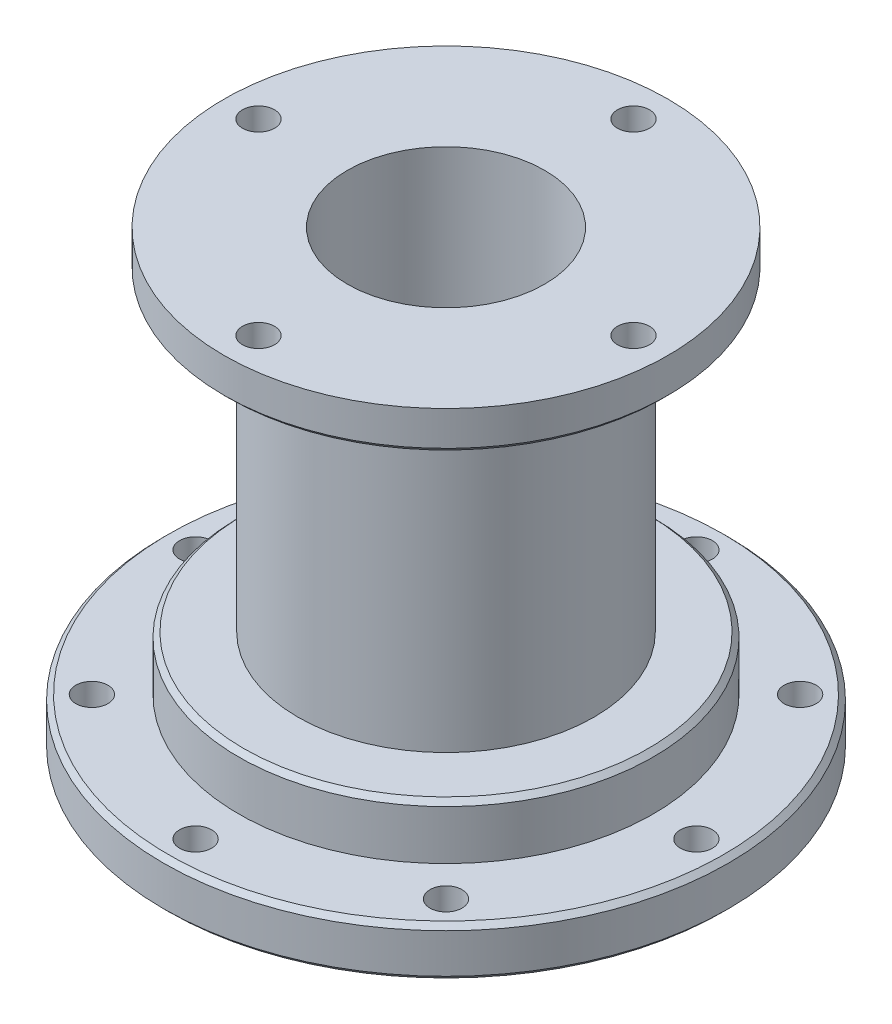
ISO-10303-21;
HEADER;
FILE_DESCRIPTION(('STEP AP214'),'2;1');
FILE_NAME('part.step','',(''),(''),'','','');
FILE_SCHEMA(('AUTOMOTIVE_DESIGN { 1 0 10303 214 1 1 1 1 }'));
ENDSEC;
DATA;
#1=APPLICATION_CONTEXT('core data for automotive mechanical design processes');
#2=APPLICATION_PROTOCOL_DEFINITION('international standard','automotive_design',2000,#1);
#3=PRODUCT_CONTEXT('',#1,'mechanical');
#4=PRODUCT('Part','Part','',(#3));
#5=PRODUCT_RELATED_PRODUCT_CATEGORY('part','',(#4));
#6=PRODUCT_DEFINITION_FORMATION('','',#4);
#7=PRODUCT_DEFINITION_CONTEXT('part definition',#1,'design');
#8=PRODUCT_DEFINITION('design','',#6,#7);
#9=PRODUCT_DEFINITION_SHAPE('','',#8);
#10=(LENGTH_UNIT() NAMED_UNIT(*) SI_UNIT(.MILLI.,.METRE.));
#11=(NAMED_UNIT(*) PLANE_ANGLE_UNIT() SI_UNIT($,.RADIAN.));
#12=(NAMED_UNIT(*) SI_UNIT($,.STERADIAN.) SOLID_ANGLE_UNIT());
#13=UNCERTAINTY_MEASURE_WITH_UNIT(LENGTH_MEASURE(1.E-05),#10,'distance_accuracy_value','');
#14=(GEOMETRIC_REPRESENTATION_CONTEXT(3) GLOBAL_UNCERTAINTY_ASSIGNED_CONTEXT((#13)) GLOBAL_UNIT_ASSIGNED_CONTEXT((#10,
#11,#12)) REPRESENTATION_CONTEXT('',''));
#15=CARTESIAN_POINT('',(0.,0.,0.));
#16=DIRECTION('',(0.,0.,1.));
#17=DIRECTION('',(1.,0.,0.));
#18=AXIS2_PLACEMENT_3D('',#15,#16,#17);
#19=CARTESIAN_POINT('',(0.,0.,0.));
#20=DIRECTION('',(0.,-1.,0.));
#21=DIRECTION('',(0.,0.,-1.));
#22=AXIS2_PLACEMENT_3D('',#19,#20,#21);
#23=CYLINDRICAL_SURFACE('',#22,30.);
#24=CARTESIAN_POINT('',(0.,21.,0.));
#25=DIRECTION('',(0.,-1.,0.));
#26=DIRECTION('',(0.,0.,-1.));
#27=AXIS2_PLACEMENT_3D('',#24,#25,#26);
#28=CIRCLE('',#27,30.);
#29=CARTESIAN_POINT('',(0.,21.,-30.));
#30=VERTEX_POINT('',#29);
#31=EDGE_CURVE('E128',#30,#30,#28,.F.);
#32=ORIENTED_EDGE('',*,*,#31,.T.);
#33=EDGE_LOOP('',(#32));
#34=FACE_BOUND('',#33,.T.);
#35=CARTESIAN_POINT('',(0.,84.,0.));
#36=DIRECTION('',(0.,-1.,0.));
#37=DIRECTION('',(0.,0.,-1.));
#38=AXIS2_PLACEMENT_3D('',#35,#36,#37);
#39=CIRCLE('',#38,30.);
#40=CARTESIAN_POINT('',(0.,84.,-30.));
#41=VERTEX_POINT('',#40);
#42=EDGE_CURVE('E18',#41,#41,#39,.T.);
#43=ORIENTED_EDGE('',*,*,#42,.T.);
#44=EDGE_LOOP('',(#43));
#45=FACE_BOUND('',#44,.T.);
#46=ADVANCED_FACE('F15',(#34,#45),#23,.T.);
#47=CARTESIAN_POINT('',(-30.,84.,0.));
#48=DIRECTION('',(0.,1.,0.));
#49=DIRECTION('',(0.,0.,1.));
#50=AXIS2_PLACEMENT_3D('',#47,#48,#49);
#51=PLANE('',#50);
#52=ORIENTED_EDGE('',*,*,#42,.F.);
#53=EDGE_LOOP('',(#52));
#54=FACE_BOUND('',#53,.T.);
#55=CARTESIAN_POINT('',(0.,84.,-38.));
#56=DIRECTION('',(0.,1.,0.));
#57=DIRECTION('',(0.,0.,1.));
#58=AXIS2_PLACEMENT_3D('',#55,#56,#57);
#59=CIRCLE('',#58,3.25);
#60=CARTESIAN_POINT('',(0.,84.,-34.75));
#61=VERTEX_POINT('',#60);
#62=EDGE_CURVE('E116',#61,#61,#59,.T.);
#63=ORIENTED_EDGE('',*,*,#62,.T.);
#64=EDGE_LOOP('',(#63));
#65=FACE_BOUND('',#64,.T.);
#66=CARTESIAN_POINT('',(38.,84.,1.32676290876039E-13));
#67=DIRECTION('',(0.,1.,0.));
#68=DIRECTION('',(0.,0.,1.));
#69=AXIS2_PLACEMENT_3D('',#66,#67,#68);
#70=CIRCLE('',#69,3.25);
#71=CARTESIAN_POINT('',(38.,84.,3.25000000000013));
#72=VERTEX_POINT('',#71);
#73=EDGE_CURVE('E119',#72,#72,#70,.T.);
#74=ORIENTED_EDGE('',*,*,#73,.T.);
#75=EDGE_LOOP('',(#74));
#76=FACE_BOUND('',#75,.T.);
#77=CARTESIAN_POINT('',(0.,84.,38.));
#78=DIRECTION('',(0.,1.,0.));
#79=DIRECTION('',(0.,0.,1.));
#80=AXIS2_PLACEMENT_3D('',#77,#78,#79);
#81=CIRCLE('',#80,3.25);
#82=CARTESIAN_POINT('',(0.,84.,41.25));
#83=VERTEX_POINT('',#82);
#84=EDGE_CURVE('E122',#83,#83,#81,.T.);
#85=ORIENTED_EDGE('',*,*,#84,.T.);
#86=EDGE_LOOP('',(#85));
#87=FACE_BOUND('',#86,.T.);
#88=CARTESIAN_POINT('',(-38.,84.,-3.98028872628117E-13));
#89=DIRECTION('',(0.,1.,0.));
#90=DIRECTION('',(0.,0.,1.));
#91=AXIS2_PLACEMENT_3D('',#88,#89,#90);
#92=CIRCLE('',#91,3.25);
#93=CARTESIAN_POINT('',(-38.,84.,3.2499999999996));
#94=VERTEX_POINT('',#93);
#95=EDGE_CURVE('E125',#94,#94,#92,.T.);
#96=ORIENTED_EDGE('',*,*,#95,.T.);
#97=EDGE_LOOP('',(#96));
#98=FACE_BOUND('',#97,.T.);
#99=CARTESIAN_POINT('',(0.,84.,0.));
#100=DIRECTION('',(0.,1.,0.));
#101=DIRECTION('',(0.,0.,1.));
#102=AXIS2_PLACEMENT_3D('',#99,#100,#101);
#103=CIRCLE('',#102,44.);
#104=CARTESIAN_POINT('',(0.,84.,44.));
#105=VERTEX_POINT('',#104);
#106=EDGE_CURVE('E130',#105,#105,#103,.T.);
#107=ORIENTED_EDGE('',*,*,#106,.F.);
#108=EDGE_LOOP('',(#107));
#109=FACE_BOUND('',#108,.T.);
#110=ADVANCED_FACE('F138',(#54,#65,#76,#87,#98,#109),#51,.F.);
#111=CARTESIAN_POINT('',(0.,85.,0.));
#112=DIRECTION('',(0.,1.,0.));
#113=DIRECTION('',(0.,0.,1.));
#114=AXIS2_PLACEMENT_3D('',#111,#112,#113);
#115=CONICAL_SURFACE('',#114,45.,0.785398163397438);
#116=CARTESIAN_POINT('',(0.,85.,0.));
#117=DIRECTION('',(0.,-1.,0.));
#118=DIRECTION('',(0.,0.,-1.));
#119=AXIS2_PLACEMENT_3D('',#116,#117,#118);
#120=CIRCLE('',#119,45.);
#121=CARTESIAN_POINT('',(0.,85.,-45.));
#122=VERTEX_POINT('',#121);
#123=EDGE_CURVE('E30',#122,#122,#120,.F.);
#124=ORIENTED_EDGE('',*,*,#123,.F.);
#125=EDGE_LOOP('',(#124));
#126=FACE_BOUND('',#125,.T.);
#127=ORIENTED_EDGE('',*,*,#106,.T.);
#128=EDGE_LOOP('',(#127));
#129=FACE_BOUND('',#128,.T.);
#130=ADVANCED_FACE('F141',(#126,#129),#115,.T.);
#131=CARTESIAN_POINT('',(-42.,21.,0.));
#132=DIRECTION('',(0.,-1.,0.));
#133=DIRECTION('',(0.,0.,-1.));
#134=AXIS2_PLACEMENT_3D('',#131,#132,#133);
#135=PLANE('',#134);
#136=ORIENTED_EDGE('',*,*,#31,.F.);
#137=EDGE_LOOP('',(#136));
#138=FACE_BOUND('',#137,.T.);
#139=CARTESIAN_POINT('',(0.,21.,0.));
#140=DIRECTION('',(0.,-1.,0.));
#141=DIRECTION('',(0.,0.,-1.));
#142=AXIS2_PLACEMENT_3D('',#139,#140,#141);
#143=CIRCLE('',#142,41.);
#144=CARTESIAN_POINT('',(0.,21.,-41.));
#145=VERTEX_POINT('',#144);
#146=EDGE_CURVE('E113',#145,#145,#143,.T.);
#147=ORIENTED_EDGE('',*,*,#146,.F.);
#148=EDGE_LOOP('',(#147));
#149=FACE_BOUND('',#148,.T.);
#150=ADVANCED_FACE('F155',(#138,#149),#135,.F.);
#151=CARTESIAN_POINT('',(-38.,74.8076118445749,-3.98028872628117E-13));
#152=DIRECTION('',(0.,1.,0.));
#153=DIRECTION('',(0.,0.,1.));
#154=AXIS2_PLACEMENT_3D('',#151,#152,#153);
#155=CYLINDRICAL_SURFACE('',#154,3.25);
#156=ORIENTED_EDGE('',*,*,#95,.F.);
#157=EDGE_LOOP('',(#156));
#158=FACE_BOUND('',#157,.T.);
#159=CARTESIAN_POINT('',(-38.,92.,-3.98028872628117E-13));
#160=DIRECTION('',(0.,1.,0.));
#161=DIRECTION('',(0.,0.,1.));
#162=AXIS2_PLACEMENT_3D('',#159,#160,#161);
#163=CIRCLE('',#162,3.25);
#164=CARTESIAN_POINT('',(-38.,92.,3.2499999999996));
#165=VERTEX_POINT('',#164);
#166=EDGE_CURVE('E110',#165,#165,#163,.T.);
#167=ORIENTED_EDGE('',*,*,#166,.T.);
#168=EDGE_LOOP('',(#167));
#169=FACE_BOUND('',#168,.T.);
#170=ADVANCED_FACE('F151',(#158,#169),#155,.F.);
#171=CARTESIAN_POINT('',(0.,74.8076118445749,38.));
#172=DIRECTION('',(0.,1.,0.));
#173=DIRECTION('',(0.,0.,1.));
#174=AXIS2_PLACEMENT_3D('',#171,#172,#173);
#175=CYLINDRICAL_SURFACE('',#174,3.25);
#176=ORIENTED_EDGE('',*,*,#84,.F.);
#177=EDGE_LOOP('',(#176));
#178=FACE_BOUND('',#177,.T.);
#179=CARTESIAN_POINT('',(0.,92.,38.));
#180=DIRECTION('',(0.,1.,0.));
#181=DIRECTION('',(0.,0.,1.));
#182=AXIS2_PLACEMENT_3D('',#179,#180,#181);
#183=CIRCLE('',#182,3.25);
#184=CARTESIAN_POINT('',(0.,92.,41.25));
#185=VERTEX_POINT('',#184);
#186=EDGE_CURVE('E107',#185,#185,#183,.T.);
#187=ORIENTED_EDGE('',*,*,#186,.T.);
#188=EDGE_LOOP('',(#187));
#189=FACE_BOUND('',#188,.T.);
#190=ADVANCED_FACE('F154',(#178,#189),#175,.F.);
#191=CARTESIAN_POINT('',(38.,74.8076118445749,1.32676290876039E-13));
#192=DIRECTION('',(0.,1.,0.));
#193=DIRECTION('',(0.,0.,1.));
#194=AXIS2_PLACEMENT_3D('',#191,#192,#193);
#195=CYLINDRICAL_SURFACE('',#194,3.25);
#196=ORIENTED_EDGE('',*,*,#73,.F.);
#197=EDGE_LOOP('',(#196));
#198=FACE_BOUND('',#197,.T.);
#199=CARTESIAN_POINT('',(38.,92.,1.32676290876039E-13));
#200=DIRECTION('',(0.,1.,0.));
#201=DIRECTION('',(0.,0.,1.));
#202=AXIS2_PLACEMENT_3D('',#199,#200,#201);
#203=CIRCLE('',#202,3.25);
#204=CARTESIAN_POINT('',(38.,92.,3.25000000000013));
#205=VERTEX_POINT('',#204);
#206=EDGE_CURVE('E104',#205,#205,#203,.T.);
#207=ORIENTED_EDGE('',*,*,#206,.T.);
#208=EDGE_LOOP('',(#207));
#209=FACE_BOUND('',#208,.T.);
#210=ADVANCED_FACE('F273',(#198,#209),#195,.F.);
#211=CARTESIAN_POINT('',(0.,74.8076118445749,-38.));
#212=DIRECTION('',(0.,1.,0.));
#213=DIRECTION('',(0.,0.,1.));
#214=AXIS2_PLACEMENT_3D('',#211,#212,#213);
#215=CYLINDRICAL_SURFACE('',#214,3.25);
#216=ORIENTED_EDGE('',*,*,#62,.F.);
#217=EDGE_LOOP('',(#216));
#218=FACE_BOUND('',#217,.T.);
#219=CARTESIAN_POINT('',(0.,92.,-38.));
#220=DIRECTION('',(0.,1.,0.));
#221=DIRECTION('',(0.,0.,1.));
#222=AXIS2_PLACEMENT_3D('',#219,#220,#221);
#223=CIRCLE('',#222,3.25);
#224=CARTESIAN_POINT('',(0.,92.,-34.75));
#225=VERTEX_POINT('',#224);
#226=EDGE_CURVE('E101',#225,#225,#223,.T.);
#227=ORIENTED_EDGE('',*,*,#226,.T.);
#228=EDGE_LOOP('',(#227));
#229=FACE_BOUND('',#228,.T.);
#230=ADVANCED_FACE('F277',(#218,#229),#215,.F.);
#231=CARTESIAN_POINT('',(0.,0.,0.));
#232=DIRECTION('',(0.,-1.,0.));
#233=DIRECTION('',(0.,0.,-1.));
#234=AXIS2_PLACEMENT_3D('',#231,#232,#233);
#235=CYLINDRICAL_SURFACE('',#234,45.);
#236=ORIENTED_EDGE('',*,*,#123,.T.);
#237=EDGE_LOOP('',(#236));
#238=FACE_BOUND('',#237,.T.);
#239=CARTESIAN_POINT('',(0.,92.,0.));
#240=DIRECTION('',(0.,-1.,0.));
#241=DIRECTION('',(0.,0.,-1.));
#242=AXIS2_PLACEMENT_3D('',#239,#240,#241);
#243=CIRCLE('',#242,45.);
#244=CARTESIAN_POINT('',(0.,92.,-45.));
#245=VERTEX_POINT('',#244);
#246=EDGE_CURVE('E98',#245,#245,#243,.T.);
#247=ORIENTED_EDGE('',*,*,#246,.T.);
#248=EDGE_LOOP('',(#247));
#249=FACE_BOUND('',#248,.T.);
#250=ADVANCED_FACE('F173',(#238,#249),#235,.T.);
#251=CARTESIAN_POINT('',(0.,20.,0.));
#252=DIRECTION('',(0.,-1.,0.));
#253=DIRECTION('',(0.,0.,-1.));
#254=AXIS2_PLACEMENT_3D('',#251,#252,#253);
#255=CONICAL_SURFACE('',#254,42.,0.785398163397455);
#256=CARTESIAN_POINT('',(0.,20.,0.));
#257=DIRECTION('',(0.,-1.,0.));
#258=DIRECTION('',(0.,0.,-1.));
#259=AXIS2_PLACEMENT_3D('',#256,#257,#258);
#260=CIRCLE('',#259,42.);
#261=CARTESIAN_POINT('',(0.,20.,-42.));
#262=VERTEX_POINT('',#261);
#263=EDGE_CURVE('E97',#262,#262,#260,.T.);
#264=ORIENTED_EDGE('',*,*,#263,.F.);
#265=EDGE_LOOP('',(#264));
#266=FACE_BOUND('',#265,.T.);
#267=ORIENTED_EDGE('',*,*,#146,.T.);
#268=EDGE_LOOP('',(#267));
#269=FACE_BOUND('',#268,.T.);
#270=ADVANCED_FACE('F162',(#266,#269),#255,.T.);
#271=CARTESIAN_POINT('',(-45.,92.,0.));
#272=DIRECTION('',(0.,-1.,0.));
#273=DIRECTION('',(0.,0.,-1.));
#274=AXIS2_PLACEMENT_3D('',#271,#272,#273);
#275=PLANE('',#274);
#276=CARTESIAN_POINT('',(0.,92.,0.));
#277=DIRECTION('',(0.,-1.,0.));
#278=DIRECTION('',(0.,0.,-1.));
#279=AXIS2_PLACEMENT_3D('',#276,#277,#278);
#280=CIRCLE('',#279,20.);
#281=CARTESIAN_POINT('',(0.,92.,-20.));
#282=VERTEX_POINT('',#281);
#283=EDGE_CURVE('E94',#282,#282,#280,.T.);
#284=ORIENTED_EDGE('',*,*,#283,.T.);
#285=EDGE_LOOP('',(#284));
#286=FACE_BOUND('',#285,.T.);
#287=ORIENTED_EDGE('',*,*,#246,.F.);
#288=EDGE_LOOP('',(#287));
#289=FACE_BOUND('',#288,.T.);
#290=ORIENTED_EDGE('',*,*,#226,.F.);
#291=EDGE_LOOP('',(#290));
#292=FACE_BOUND('',#291,.T.);
#293=ORIENTED_EDGE('',*,*,#206,.F.);
#294=EDGE_LOOP('',(#293));
#295=FACE_BOUND('',#294,.T.);
#296=ORIENTED_EDGE('',*,*,#186,.F.);
#297=EDGE_LOOP('',(#296));
#298=FACE_BOUND('',#297,.T.);
#299=ORIENTED_EDGE('',*,*,#166,.F.);
#300=EDGE_LOOP('',(#299));
#301=FACE_BOUND('',#300,.T.);
#302=ADVANCED_FACE('F159',(#286,#289,#292,#295,#298,#301),#275,.F.);
#303=CARTESIAN_POINT('',(0.,9.00000000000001,0.));
#304=DIRECTION('',(0.,-1.,0.));
#305=DIRECTION('',(0.,0.,-1.));
#306=AXIS2_PLACEMENT_3D('',#303,#304,#305);
#307=CONICAL_SURFACE('',#306,57.25,0.785398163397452);
#308=CARTESIAN_POINT('',(0.,10.,0.));
#309=DIRECTION('',(0.,-1.,0.));
#310=DIRECTION('',(0.,0.,-1.));
#311=AXIS2_PLACEMENT_3D('',#308,#309,#310);
#312=CIRCLE('',#311,56.25);
#313=CARTESIAN_POINT('',(0.,10.,-56.25));
#314=VERTEX_POINT('',#313);
#315=EDGE_CURVE('E90',#314,#314,#312,.T.);
#316=ORIENTED_EDGE('',*,*,#315,.T.);
#317=EDGE_LOOP('',(#316));
#318=FACE_BOUND('',#317,.T.);
#319=CARTESIAN_POINT('',(0.,9.00000000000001,0.));
#320=DIRECTION('',(0.,-1.,0.));
#321=DIRECTION('',(0.,0.,-1.));
#322=AXIS2_PLACEMENT_3D('',#319,#320,#321);
#323=CIRCLE('',#322,57.25);
#324=CARTESIAN_POINT('',(0.,9.00000000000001,-57.25));
#325=VERTEX_POINT('',#324);
#326=EDGE_CURVE('E93',#325,#325,#323,.T.);
#327=ORIENTED_EDGE('',*,*,#326,.F.);
#328=EDGE_LOOP('',(#327));
#329=FACE_BOUND('',#328,.T.);
#330=ADVANCED_FACE('F161',(#318,#329),#307,.T.);
#331=CARTESIAN_POINT('',(0.,0.,0.));
#332=DIRECTION('',(0.,-1.,0.));
#333=DIRECTION('',(0.,0.,-1.));
#334=AXIS2_PLACEMENT_3D('',#331,#332,#333);
#335=CYLINDRICAL_SURFACE('',#334,42.);
#336=CARTESIAN_POINT('',(0.,10.,0.));
#337=DIRECTION('',(0.,-1.,0.));
#338=DIRECTION('',(0.,0.,-1.));
#339=AXIS2_PLACEMENT_3D('',#336,#337,#338);
#340=CIRCLE('',#339,42.);
#341=CARTESIAN_POINT('',(0.,10.,-42.));
#342=VERTEX_POINT('',#341);
#343=EDGE_CURVE('E87',#342,#342,#340,.F.);
#344=ORIENTED_EDGE('',*,*,#343,.T.);
#345=EDGE_LOOP('',(#344));
#346=FACE_BOUND('',#345,.T.);
#347=ORIENTED_EDGE('',*,*,#263,.T.);
#348=EDGE_LOOP('',(#347));
#349=FACE_BOUND('',#348,.T.);
#350=ADVANCED_FACE('F170',(#346,#349),#335,.T.);
#351=CARTESIAN_POINT('',(0.,0.,0.));
#352=DIRECTION('',(0.,-1.,0.));
#353=DIRECTION('',(0.,0.,-1.));
#354=AXIS2_PLACEMENT_3D('',#351,#352,#353);
#355=CYLINDRICAL_SURFACE('',#354,20.);
#356=ORIENTED_EDGE('',*,*,#283,.F.);
#357=EDGE_LOOP('',(#356));
#358=FACE_BOUND('',#357,.T.);
#359=CARTESIAN_POINT('',(0.,13.,0.));
#360=DIRECTION('',(0.,-1.,0.));
#361=DIRECTION('',(0.,0.,-1.));
#362=AXIS2_PLACEMENT_3D('',#359,#360,#361);
#363=CIRCLE('',#362,20.);
#364=CARTESIAN_POINT('',(0.,13.,-20.));
#365=VERTEX_POINT('',#364);
#366=EDGE_CURVE('E84',#365,#365,#363,.T.);
#367=ORIENTED_EDGE('',*,*,#366,.T.);
#368=EDGE_LOOP('',(#367));
#369=FACE_BOUND('',#368,.T.);
#370=ADVANCED_FACE('F236',(#358,#369),#355,.F.);
#371=CARTESIAN_POINT('',(0.,0.,0.));
#372=DIRECTION('',(0.,-1.,0.));
#373=DIRECTION('',(0.,0.,-1.));
#374=AXIS2_PLACEMENT_3D('',#371,#372,#373);
#375=CYLINDRICAL_SURFACE('',#374,57.25);
#376=ORIENTED_EDGE('',*,*,#326,.T.);
#377=EDGE_LOOP('',(#376));
#378=FACE_BOUND('',#377,.T.);
#379=CARTESIAN_POINT('',(0.,1.00000000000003,0.));
#380=DIRECTION('',(0.,1.,0.));
#381=DIRECTION('',(0.,0.,1.));
#382=AXIS2_PLACEMENT_3D('',#379,#380,#381);
#383=CIRCLE('',#382,57.25);
#384=CARTESIAN_POINT('',(0.,1.00000000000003,57.25));
#385=VERTEX_POINT('',#384);
#386=EDGE_CURVE('E83',#385,#385,#383,.F.);
#387=ORIENTED_EDGE('',*,*,#386,.F.);
#388=EDGE_LOOP('',(#387));
#389=FACE_BOUND('',#388,.T.);
#390=ADVANCED_FACE('F232',(#378,#389),#375,.T.);
#391=CARTESIAN_POINT('',(-57.25,10.,0.));
#392=DIRECTION('',(0.,-1.,0.));
#393=DIRECTION('',(0.,0.,-1.));
#394=AXIS2_PLACEMENT_3D('',#391,#392,#393);
#395=PLANE('',#394);
#396=ORIENTED_EDGE('',*,*,#343,.F.);
#397=EDGE_LOOP('',(#396));
#398=FACE_BOUND('',#397,.T.);
#399=CARTESIAN_POINT('',(-50.75,10.,0.));
#400=DIRECTION('',(0.,1.,0.));
#401=DIRECTION('',(-1.,0.,0.));
#402=AXIS2_PLACEMENT_3D('',#399,#400,#401);
#403=CIRCLE('',#402,3.25);
#404=CARTESIAN_POINT('',(-54.,10.,0.));
#405=VERTEX_POINT('',#404);
#406=EDGE_CURVE('E59',#405,#405,#403,.F.);
#407=ORIENTED_EDGE('',*,*,#406,.T.);
#408=EDGE_LOOP('',(#407));
#409=FACE_BOUND('',#408,.T.);
#410=CARTESIAN_POINT('',(-35.8856691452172,10.,-35.8856691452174));
#411=DIRECTION('',(0.,1.,0.));
#412=DIRECTION('',(0.,0.,1.));
#413=AXIS2_PLACEMENT_3D('',#410,#411,#412);
#414=CIRCLE('',#413,3.24999999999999);
#415=CARTESIAN_POINT('',(-35.8856691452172,10.,-32.6356691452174));
#416=VERTEX_POINT('',#415);
#417=EDGE_CURVE('E62',#416,#416,#414,.F.);
#418=ORIENTED_EDGE('',*,*,#417,.T.);
#419=EDGE_LOOP('',(#418));
#420=FACE_BOUND('',#419,.T.);
#421=CARTESIAN_POINT('',(1.77192677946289E-13,10.,-50.75));
#422=DIRECTION('',(0.,1.,0.));
#423=DIRECTION('',(0.,0.,1.));
#424=AXIS2_PLACEMENT_3D('',#421,#422,#423);
#425=CIRCLE('',#424,3.25);
#426=CARTESIAN_POINT('',(1.77192677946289E-13,10.,-47.5));
#427=VERTEX_POINT('',#426);
#428=EDGE_CURVE('E65',#427,#427,#425,.F.);
#429=ORIENTED_EDGE('',*,*,#428,.T.);
#430=EDGE_LOOP('',(#429));
#431=FACE_BOUND('',#430,.T.);
#432=CARTESIAN_POINT('',(35.8856691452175,10.,-35.8856691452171));
#433=DIRECTION('',(0.,1.,0.));
#434=DIRECTION('',(-1.,0.,0.));
#435=AXIS2_PLACEMENT_3D('',#432,#433,#434);
#436=CIRCLE('',#435,3.24999999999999);
#437=CARTESIAN_POINT('',(32.6356691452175,10.,-35.8856691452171));
#438=VERTEX_POINT('',#437);
#439=EDGE_CURVE('E68',#438,#438,#436,.F.);
#440=ORIENTED_EDGE('',*,*,#439,.T.);
#441=EDGE_LOOP('',(#440));
#442=FACE_BOUND('',#441,.T.);
#443=CARTESIAN_POINT('',(50.75,10.,0.));
#444=DIRECTION('',(0.,1.,0.));
#445=DIRECTION('',(-1.,0.,0.));
#446=AXIS2_PLACEMENT_3D('',#443,#444,#445);
#447=CIRCLE('',#446,3.25);
#448=CARTESIAN_POINT('',(47.5,10.,0.));
#449=VERTEX_POINT('',#448);
#450=EDGE_CURVE('E71',#449,#449,#447,.F.);
#451=ORIENTED_EDGE('',*,*,#450,.T.);
#452=EDGE_LOOP('',(#451));
#453=FACE_BOUND('',#452,.T.);
#454=CARTESIAN_POINT('',(35.885669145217,10.,35.8856691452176));
#455=DIRECTION('',(0.,1.,0.));
#456=DIRECTION('',(0.,0.,1.));
#457=AXIS2_PLACEMENT_3D('',#454,#455,#456);
#458=CIRCLE('',#457,3.25);
#459=CARTESIAN_POINT('',(35.885669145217,10.,39.1356691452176));
#460=VERTEX_POINT('',#459);
#461=EDGE_CURVE('E74',#460,#460,#458,.F.);
#462=ORIENTED_EDGE('',*,*,#461,.T.);
#463=EDGE_LOOP('',(#462));
#464=FACE_BOUND('',#463,.T.);
#465=CARTESIAN_POINT('',(-5.31578033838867E-13,10.,50.75));
#466=DIRECTION('',(0.,1.,0.));
#467=DIRECTION('',(0.,0.,1.));
#468=AXIS2_PLACEMENT_3D('',#465,#466,#467);
#469=CIRCLE('',#468,3.25);
#470=CARTESIAN_POINT('',(-5.31578033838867E-13,10.,54.));
#471=VERTEX_POINT('',#470);
#472=EDGE_CURVE('E77',#471,#471,#469,.F.);
#473=ORIENTED_EDGE('',*,*,#472,.T.);
#474=EDGE_LOOP('',(#473));
#475=FACE_BOUND('',#474,.T.);
#476=CARTESIAN_POINT('',(-35.8856691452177,10.,35.8856691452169));
#477=DIRECTION('',(0.,1.,0.));
#478=DIRECTION('',(-1.,0.,0.));
#479=AXIS2_PLACEMENT_3D('',#476,#477,#478);
#480=CIRCLE('',#479,3.25);
#481=CARTESIAN_POINT('',(-39.1356691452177,10.,35.8856691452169));
#482=VERTEX_POINT('',#481);
#483=EDGE_CURVE('E80',#482,#482,#480,.F.);
#484=ORIENTED_EDGE('',*,*,#483,.T.);
#485=EDGE_LOOP('',(#484));
#486=FACE_BOUND('',#485,.T.);
#487=ORIENTED_EDGE('',*,*,#315,.F.);
#488=EDGE_LOOP('',(#487));
#489=FACE_BOUND('',#488,.T.);
#490=ADVANCED_FACE('F228',(#398,#409,#420,#431,#442,#453,#464,#475,#486,#489),#395,.F.);
#491=CARTESIAN_POINT('',(-32.,13.,0.));
#492=DIRECTION('',(0.,1.,0.));
#493=DIRECTION('',(0.,0.,1.));
#494=AXIS2_PLACEMENT_3D('',#491,#492,#493);
#495=PLANE('',#494);
#496=CARTESIAN_POINT('',(0.,13.,0.));
#497=DIRECTION('',(0.,-1.,0.));
#498=DIRECTION('',(0.,0.,-1.));
#499=AXIS2_PLACEMENT_3D('',#496,#497,#498);
#500=CIRCLE('',#499,32.);
#501=CARTESIAN_POINT('',(0.,13.,-32.));
#502=VERTEX_POINT('',#501);
#503=EDGE_CURVE('E56',#502,#502,#500,.T.);
#504=ORIENTED_EDGE('',*,*,#503,.T.);
#505=EDGE_LOOP('',(#504));
#506=FACE_BOUND('',#505,.T.);
#507=ORIENTED_EDGE('',*,*,#366,.F.);
#508=EDGE_LOOP('',(#507));
#509=FACE_BOUND('',#508,.T.);
#510=ADVANCED_FACE('F224',(#506,#509),#495,.F.);
#511=CARTESIAN_POINT('',(0.,1.00000000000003,0.));
#512=DIRECTION('',(0.,1.,0.));
#513=DIRECTION('',(0.,0.,1.));
#514=AXIS2_PLACEMENT_3D('',#511,#512,#513);
#515=CONICAL_SURFACE('',#514,57.25,0.78539816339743);
#516=CARTESIAN_POINT('',(0.,0.,0.));
#517=DIRECTION('',(0.,1.,0.));
#518=DIRECTION('',(0.,0.,1.));
#519=AXIS2_PLACEMENT_3D('',#516,#517,#518);
#520=CIRCLE('',#519,56.25);
#521=CARTESIAN_POINT('',(0.,0.,56.25));
#522=VERTEX_POINT('',#521);
#523=EDGE_CURVE('E53',#522,#522,#520,.T.);
#524=ORIENTED_EDGE('',*,*,#523,.T.);
#525=EDGE_LOOP('',(#524));
#526=FACE_BOUND('',#525,.T.);
#527=ORIENTED_EDGE('',*,*,#386,.T.);
#528=EDGE_LOOP('',(#527));
#529=FACE_BOUND('',#528,.T.);
#530=ADVANCED_FACE('F220',(#526,#529),#515,.T.);
#531=CARTESIAN_POINT('',(-35.8856691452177,29.5402438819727,35.8856691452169));
#532=DIRECTION('',(0.,1.,0.));
#533=DIRECTION('',(-1.,0.,0.));
#534=AXIS2_PLACEMENT_3D('',#531,#532,#533);
#535=CYLINDRICAL_SURFACE('',#534,3.25);
#536=CARTESIAN_POINT('',(-35.8856691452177,0.,35.8856691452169));
#537=DIRECTION('',(0.,1.,0.));
#538=DIRECTION('',(-1.,0.,0.));
#539=AXIS2_PLACEMENT_3D('',#536,#537,#538);
#540=CIRCLE('',#539,3.25);
#541=CARTESIAN_POINT('',(-39.1356691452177,0.,35.8856691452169));
#542=VERTEX_POINT('',#541);
#543=EDGE_CURVE('E50',#542,#542,#540,.F.);
#544=ORIENTED_EDGE('',*,*,#543,.T.);
#545=EDGE_LOOP('',(#544));
#546=FACE_BOUND('',#545,.T.);
#547=ORIENTED_EDGE('',*,*,#483,.F.);
#548=EDGE_LOOP('',(#547));
#549=FACE_BOUND('',#548,.T.);
#550=ADVANCED_FACE('F216',(#546,#549),#535,.F.);
#551=CARTESIAN_POINT('',(-5.31578033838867E-13,29.5402438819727,50.75));
#552=DIRECTION('',(0.,1.,0.));
#553=DIRECTION('',(0.,0.,1.));
#554=AXIS2_PLACEMENT_3D('',#551,#552,#553);
#555=CYLINDRICAL_SURFACE('',#554,3.25);
#556=CARTESIAN_POINT('',(-5.31578033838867E-13,0.,50.75));
#557=DIRECTION('',(0.,1.,0.));
#558=DIRECTION('',(0.,0.,1.));
#559=AXIS2_PLACEMENT_3D('',#556,#557,#558);
#560=CIRCLE('',#559,3.25);
#561=CARTESIAN_POINT('',(-5.31578033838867E-13,0.,54.));
#562=VERTEX_POINT('',#561);
#563=EDGE_CURVE('E47',#562,#562,#560,.F.);
#564=ORIENTED_EDGE('',*,*,#563,.T.);
#565=EDGE_LOOP('',(#564));
#566=FACE_BOUND('',#565,.T.);
#567=ORIENTED_EDGE('',*,*,#472,.F.);
#568=EDGE_LOOP('',(#567));
#569=FACE_BOUND('',#568,.T.);
#570=ADVANCED_FACE('F212',(#566,#569),#555,.F.);
#571=CARTESIAN_POINT('',(35.885669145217,29.5402438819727,35.8856691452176));
#572=DIRECTION('',(0.,1.,0.));
#573=DIRECTION('',(0.,0.,1.));
#574=AXIS2_PLACEMENT_3D('',#571,#572,#573);
#575=CYLINDRICAL_SURFACE('',#574,3.25);
#576=CARTESIAN_POINT('',(35.885669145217,0.,35.8856691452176));
#577=DIRECTION('',(0.,1.,0.));
#578=DIRECTION('',(0.,0.,1.));
#579=AXIS2_PLACEMENT_3D('',#576,#577,#578);
#580=CIRCLE('',#579,3.25);
#581=CARTESIAN_POINT('',(35.885669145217,0.,39.1356691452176));
#582=VERTEX_POINT('',#581);
#583=EDGE_CURVE('E44',#582,#582,#580,.F.);
#584=ORIENTED_EDGE('',*,*,#583,.T.);
#585=EDGE_LOOP('',(#584));
#586=FACE_BOUND('',#585,.T.);
#587=ORIENTED_EDGE('',*,*,#461,.F.);
#588=EDGE_LOOP('',(#587));
#589=FACE_BOUND('',#588,.T.);
#590=ADVANCED_FACE('F208',(#586,#589),#575,.F.);
#591=CARTESIAN_POINT('',(50.75,29.5402438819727,0.));
#592=DIRECTION('',(0.,1.,0.));
#593=DIRECTION('',(-1.,0.,0.));
#594=AXIS2_PLACEMENT_3D('',#591,#592,#593);
#595=CYLINDRICAL_SURFACE('',#594,3.25);
#596=CARTESIAN_POINT('',(50.75,0.,0.));
#597=DIRECTION('',(0.,1.,0.));
#598=DIRECTION('',(-1.,0.,0.));
#599=AXIS2_PLACEMENT_3D('',#596,#597,#598);
#600=CIRCLE('',#599,3.25);
#601=CARTESIAN_POINT('',(47.5,0.,0.));
#602=VERTEX_POINT('',#601);
#603=EDGE_CURVE('E41',#602,#602,#600,.F.);
#604=ORIENTED_EDGE('',*,*,#603,.T.);
#605=EDGE_LOOP('',(#604));
#606=FACE_BOUND('',#605,.T.);
#607=ORIENTED_EDGE('',*,*,#450,.F.);
#608=EDGE_LOOP('',(#607));
#609=FACE_BOUND('',#608,.T.);
#610=ADVANCED_FACE('F204',(#606,#609),#595,.F.);
#611=CARTESIAN_POINT('',(35.8856691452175,29.5402438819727,-35.8856691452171));
#612=DIRECTION('',(0.,1.,0.));
#613=DIRECTION('',(-1.,0.,0.));
#614=AXIS2_PLACEMENT_3D('',#611,#612,#613);
#615=CYLINDRICAL_SURFACE('',#614,3.24999999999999);
#616=CARTESIAN_POINT('',(35.8856691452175,0.,-35.8856691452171));
#617=DIRECTION('',(0.,1.,0.));
#618=DIRECTION('',(-1.,0.,0.));
#619=AXIS2_PLACEMENT_3D('',#616,#617,#618);
#620=CIRCLE('',#619,3.24999999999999);
#621=CARTESIAN_POINT('',(32.6356691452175,0.,-35.8856691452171));
#622=VERTEX_POINT('',#621);
#623=EDGE_CURVE('E38',#622,#622,#620,.F.);
#624=ORIENTED_EDGE('',*,*,#623,.T.);
#625=EDGE_LOOP('',(#624));
#626=FACE_BOUND('',#625,.T.);
#627=ORIENTED_EDGE('',*,*,#439,.F.);
#628=EDGE_LOOP('',(#627));
#629=FACE_BOUND('',#628,.T.);
#630=ADVANCED_FACE('F200',(#626,#629),#615,.F.);
#631=CARTESIAN_POINT('',(1.77192677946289E-13,29.5402438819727,-50.75));
#632=DIRECTION('',(0.,1.,0.));
#633=DIRECTION('',(0.,0.,1.));
#634=AXIS2_PLACEMENT_3D('',#631,#632,#633);
#635=CYLINDRICAL_SURFACE('',#634,3.25);
#636=CARTESIAN_POINT('',(1.77192677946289E-13,0.,-50.75));
#637=DIRECTION('',(0.,1.,0.));
#638=DIRECTION('',(0.,0.,1.));
#639=AXIS2_PLACEMENT_3D('',#636,#637,#638);
#640=CIRCLE('',#639,3.25);
#641=CARTESIAN_POINT('',(1.77192677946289E-13,0.,-47.5));
#642=VERTEX_POINT('',#641);
#643=EDGE_CURVE('E35',#642,#642,#640,.F.);
#644=ORIENTED_EDGE('',*,*,#643,.T.);
#645=EDGE_LOOP('',(#644));
#646=FACE_BOUND('',#645,.T.);
#647=ORIENTED_EDGE('',*,*,#428,.F.);
#648=EDGE_LOOP('',(#647));
#649=FACE_BOUND('',#648,.T.);
#650=ADVANCED_FACE('F196',(#646,#649),#635,.F.);
#651=CARTESIAN_POINT('',(-35.8856691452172,29.5402438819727,-35.8856691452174));
#652=DIRECTION('',(0.,1.,0.));
#653=DIRECTION('',(0.,0.,1.));
#654=AXIS2_PLACEMENT_3D('',#651,#652,#653);
#655=CYLINDRICAL_SURFACE('',#654,3.24999999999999);
#656=CARTESIAN_POINT('',(-35.8856691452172,0.,-35.8856691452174));
#657=DIRECTION('',(0.,1.,0.));
#658=DIRECTION('',(0.,0.,1.));
#659=AXIS2_PLACEMENT_3D('',#656,#657,#658);
#660=CIRCLE('',#659,3.24999999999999);
#661=CARTESIAN_POINT('',(-35.8856691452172,0.,-32.6356691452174));
#662=VERTEX_POINT('',#661);
#663=EDGE_CURVE('E27',#662,#662,#660,.F.);
#664=ORIENTED_EDGE('',*,*,#663,.T.);
#665=EDGE_LOOP('',(#664));
#666=FACE_BOUND('',#665,.T.);
#667=ORIENTED_EDGE('',*,*,#417,.F.);
#668=EDGE_LOOP('',(#667));
#669=FACE_BOUND('',#668,.T.);
#670=ADVANCED_FACE('F192',(#666,#669),#655,.F.);
#671=CARTESIAN_POINT('',(-50.75,29.5402438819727,0.));
#672=DIRECTION('',(0.,1.,0.));
#673=DIRECTION('',(-1.,0.,0.));
#674=AXIS2_PLACEMENT_3D('',#671,#672,#673);
#675=CYLINDRICAL_SURFACE('',#674,3.25);
#676=CARTESIAN_POINT('',(-50.75,0.,0.));
#677=DIRECTION('',(0.,1.,0.));
#678=DIRECTION('',(-1.,0.,0.));
#679=AXIS2_PLACEMENT_3D('',#676,#677,#678);
#680=CIRCLE('',#679,3.25);
#681=CARTESIAN_POINT('',(-54.,0.,0.));
#682=VERTEX_POINT('',#681);
#683=EDGE_CURVE('E22',#682,#682,#680,.F.);
#684=ORIENTED_EDGE('',*,*,#683,.T.);
#685=EDGE_LOOP('',(#684));
#686=FACE_BOUND('',#685,.T.);
#687=ORIENTED_EDGE('',*,*,#406,.F.);
#688=EDGE_LOOP('',(#687));
#689=FACE_BOUND('',#688,.T.);
#690=ADVANCED_FACE('F185',(#686,#689),#675,.F.);
#691=CARTESIAN_POINT('',(0.,0.,0.));
#692=DIRECTION('',(0.,-1.,0.));
#693=DIRECTION('',(0.,0.,-1.));
#694=AXIS2_PLACEMENT_3D('',#691,#692,#693);
#695=CYLINDRICAL_SURFACE('',#694,32.);
#696=ORIENTED_EDGE('',*,*,#503,.F.);
#697=EDGE_LOOP('',(#696));
#698=FACE_BOUND('',#697,.T.);
#699=CARTESIAN_POINT('',(0.,0.,0.));
#700=DIRECTION('',(0.,-1.,0.));
#701=DIRECTION('',(0.,0.,-1.));
#702=AXIS2_PLACEMENT_3D('',#699,#700,#701);
#703=CIRCLE('',#702,32.);
#704=CARTESIAN_POINT('',(0.,0.,-32.));
#705=VERTEX_POINT('',#704);
#706=EDGE_CURVE('E10',#705,#705,#703,.T.);
#707=ORIENTED_EDGE('',*,*,#706,.T.);
#708=EDGE_LOOP('',(#707));
#709=FACE_BOUND('',#708,.T.);
#710=ADVANCED_FACE('F179',(#698,#709),#695,.F.);
#711=CARTESIAN_POINT('',(-57.25,0.,0.));
#712=DIRECTION('',(0.,1.,0.));
#713=DIRECTION('',(0.,0.,1.));
#714=AXIS2_PLACEMENT_3D('',#711,#712,#713);
#715=PLANE('',#714);
#716=ORIENTED_EDGE('',*,*,#706,.F.);
#717=EDGE_LOOP('',(#716));
#718=FACE_BOUND('',#717,.T.);
#719=ORIENTED_EDGE('',*,*,#683,.F.);
#720=EDGE_LOOP('',(#719));
#721=FACE_BOUND('',#720,.T.);
#722=ORIENTED_EDGE('',*,*,#663,.F.);
#723=EDGE_LOOP('',(#722));
#724=FACE_BOUND('',#723,.T.);
#725=ORIENTED_EDGE('',*,*,#643,.F.);
#726=EDGE_LOOP('',(#725));
#727=FACE_BOUND('',#726,.T.);
#728=ORIENTED_EDGE('',*,*,#623,.F.);
#729=EDGE_LOOP('',(#728));
#730=FACE_BOUND('',#729,.T.);
#731=ORIENTED_EDGE('',*,*,#603,.F.);
#732=EDGE_LOOP('',(#731));
#733=FACE_BOUND('',#732,.T.);
#734=ORIENTED_EDGE('',*,*,#583,.F.);
#735=EDGE_LOOP('',(#734));
#736=FACE_BOUND('',#735,.T.);
#737=ORIENTED_EDGE('',*,*,#563,.F.);
#738=EDGE_LOOP('',(#737));
#739=FACE_BOUND('',#738,.T.);
#740=ORIENTED_EDGE('',*,*,#543,.F.);
#741=EDGE_LOOP('',(#740));
#742=FACE_BOUND('',#741,.T.);
#743=ORIENTED_EDGE('',*,*,#523,.F.);
#744=EDGE_LOOP('',(#743));
#745=FACE_BOUND('',#744,.T.);
#746=ADVANCED_FACE('F177',(#718,#721,#724,#727,#730,#733,#736,#739,#742,#745),#715,.F.);
#747=CLOSED_SHELL('',(#46,#110,#130,#150,#170,#190,#210,#230,#250,#270,#302,#330,#350,#370,#390,
#490,#510,#530,#550,#570,#590,#610,#630,#650,#670,#690,#710,#746));
#748=MANIFOLD_SOLID_BREP('B1',#747);
#749=ADVANCED_BREP_SHAPE_REPRESENTATION('',(#18,#748),#14);
#750=SHAPE_DEFINITION_REPRESENTATION(#9,#749);
ENDSEC;
END-ISO-10303-21;
